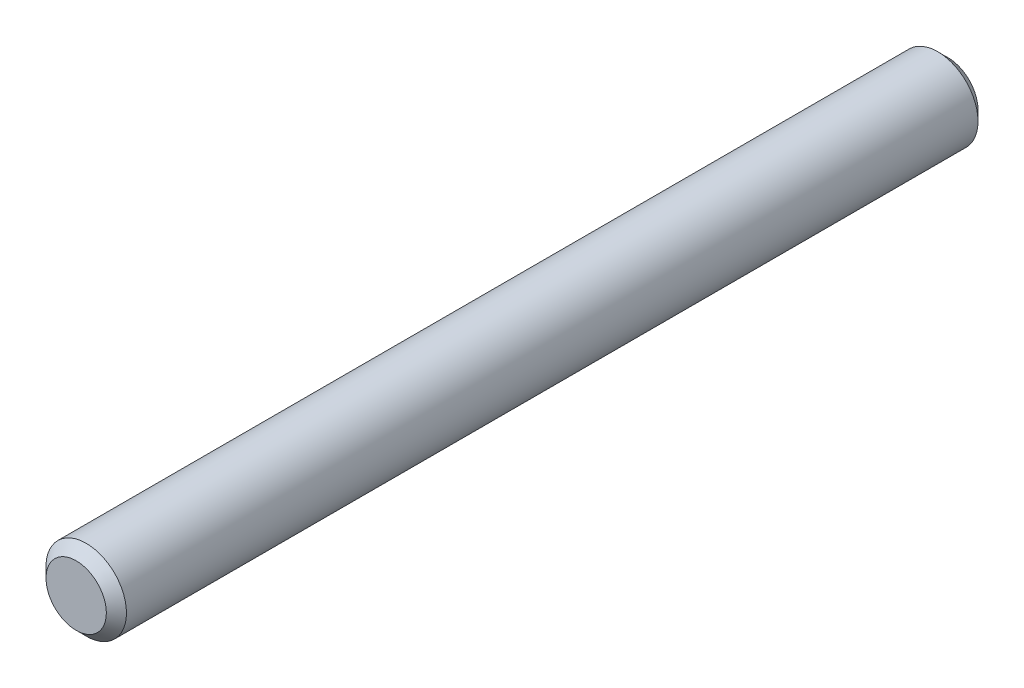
ISO-10303-21;
HEADER;
FILE_DESCRIPTION(('STEP AP214'),'2;1');
FILE_NAME('part.step','',(''),(''),'','','');
FILE_SCHEMA(('AUTOMOTIVE_DESIGN { 1 0 10303 214 1 1 1 1 }'));
ENDSEC;
DATA;
#1=APPLICATION_CONTEXT('core data for automotive mechanical design processes');
#2=APPLICATION_PROTOCOL_DEFINITION('international standard','automotive_design',2000,#1);
#3=PRODUCT_CONTEXT('',#1,'mechanical');
#4=PRODUCT('Part','Part','',(#3));
#5=PRODUCT_RELATED_PRODUCT_CATEGORY('part','',(#4));
#6=PRODUCT_DEFINITION_FORMATION('','',#4);
#7=PRODUCT_DEFINITION_CONTEXT('part definition',#1,'design');
#8=PRODUCT_DEFINITION('design','',#6,#7);
#9=PRODUCT_DEFINITION_SHAPE('','',#8);
#10=(LENGTH_UNIT() NAMED_UNIT(*) SI_UNIT(.MILLI.,.METRE.));
#11=(NAMED_UNIT(*) PLANE_ANGLE_UNIT() SI_UNIT($,.RADIAN.));
#12=(NAMED_UNIT(*) SI_UNIT($,.STERADIAN.) SOLID_ANGLE_UNIT());
#13=UNCERTAINTY_MEASURE_WITH_UNIT(LENGTH_MEASURE(1.E-05),#10,'distance_accuracy_value','');
#14=(GEOMETRIC_REPRESENTATION_CONTEXT(3) GLOBAL_UNCERTAINTY_ASSIGNED_CONTEXT((#13)) GLOBAL_UNIT_ASSIGNED_CONTEXT((#10,
#11,#12)) REPRESENTATION_CONTEXT('',''));
#15=CARTESIAN_POINT('',(0.,0.,0.));
#16=DIRECTION('',(0.,0.,1.));
#17=DIRECTION('',(1.,0.,0.));
#18=AXIS2_PLACEMENT_3D('',#15,#16,#17);
#19=CARTESIAN_POINT('',(0.,0.,-130.));
#20=DIRECTION('',(0.,0.,1.));
#21=DIRECTION('',(1.,0.,0.));
#22=AXIS2_PLACEMENT_3D('',#19,#20,#21);
#23=CYLINDRICAL_SURFACE('',#22,6.);
#24=CARTESIAN_POINT('',(0.,0.,-128.5));
#25=DIRECTION('',(0.,0.,1.));
#26=DIRECTION('',(1.,0.,0.));
#27=AXIS2_PLACEMENT_3D('',#24,#25,#26);
#28=CIRCLE('',#27,6.);
#29=CARTESIAN_POINT('',(6.,0.,-128.5));
#30=VERTEX_POINT('',#29);
#31=EDGE_CURVE('E46',#30,#30,#28,.T.);
#32=ORIENTED_EDGE('',*,*,#31,.T.);
#33=EDGE_LOOP('',(#32));
#34=FACE_BOUND('',#33,.T.);
#35=CARTESIAN_POINT('',(0.,0.,-1.5));
#36=DIRECTION('',(0.,0.,1.));
#37=DIRECTION('',(1.,0.,0.));
#38=AXIS2_PLACEMENT_3D('',#35,#36,#37);
#39=CIRCLE('',#38,6.);
#40=CARTESIAN_POINT('',(6.,0.,-1.5));
#41=VERTEX_POINT('',#40);
#42=EDGE_CURVE('E50',#41,#41,#39,.F.);
#43=ORIENTED_EDGE('',*,*,#42,.T.);
#44=EDGE_LOOP('',(#43));
#45=FACE_BOUND('',#44,.T.);
#46=ADVANCED_FACE('F35',(#34,#45),#23,.T.);
#47=CARTESIAN_POINT('',(0.,0.,-130.));
#48=DIRECTION('',(0.,0.,1.));
#49=DIRECTION('',(1.,0.,0.));
#50=AXIS2_PLACEMENT_3D('',#47,#48,#49);
#51=PLANE('',#50);
#52=CARTESIAN_POINT('',(0.,0.,-130.));
#53=DIRECTION('',(0.,0.,1.));
#54=DIRECTION('',(1.,0.,0.));
#55=AXIS2_PLACEMENT_3D('',#52,#53,#54);
#56=CIRCLE('',#55,4.49999999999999);
#57=CARTESIAN_POINT('',(4.49999999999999,0.,-130.));
#58=VERTEX_POINT('',#57);
#59=EDGE_CURVE('E42',#58,#58,#56,.F.);
#60=ORIENTED_EDGE('',*,*,#59,.T.);
#61=EDGE_LOOP('',(#60));
#62=FACE_BOUND('',#61,.T.);
#63=ADVANCED_FACE('F66',(#62),#51,.F.);
#64=CARTESIAN_POINT('',(0.,0.,0.));
#65=DIRECTION('',(0.,0.,1.));
#66=DIRECTION('',(1.,0.,0.));
#67=AXIS2_PLACEMENT_3D('',#64,#65,#66);
#68=PLANE('',#67);
#69=CARTESIAN_POINT('',(0.,0.,0.));
#70=DIRECTION('',(0.,0.,1.));
#71=DIRECTION('',(1.,0.,0.));
#72=AXIS2_PLACEMENT_3D('',#69,#70,#71);
#73=CIRCLE('',#72,4.50000000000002);
#74=CARTESIAN_POINT('',(4.50000000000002,0.,0.));
#75=VERTEX_POINT('',#74);
#76=EDGE_CURVE('E10',#75,#75,#73,.T.);
#77=ORIENTED_EDGE('',*,*,#76,.T.);
#78=EDGE_LOOP('',(#77));
#79=FACE_BOUND('',#78,.T.);
#80=ADVANCED_FACE('F63',(#79),#68,.T.);
#81=CARTESIAN_POINT('',(0.,0.,-128.5));
#82=DIRECTION('',(0.,0.,1.));
#83=DIRECTION('',(1.,0.,0.));
#84=AXIS2_PLACEMENT_3D('',#81,#82,#83);
#85=CONICAL_SURFACE('',#84,6.,0.785398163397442);
#86=ORIENTED_EDGE('',*,*,#59,.F.);
#87=EDGE_LOOP('',(#86));
#88=FACE_BOUND('',#87,.T.);
#89=ORIENTED_EDGE('',*,*,#31,.F.);
#90=EDGE_LOOP('',(#89));
#91=FACE_BOUND('',#90,.T.);
#92=ADVANCED_FACE('F59',(#88,#91),#85,.T.);
#93=CARTESIAN_POINT('',(0.,0.,0.));
#94=DIRECTION('',(0.,0.,-1.));
#95=DIRECTION('',(-1.,0.,0.));
#96=AXIS2_PLACEMENT_3D('',#93,#94,#95);
#97=CONICAL_SURFACE('',#96,4.50000000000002,0.785398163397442);
#98=ORIENTED_EDGE('',*,*,#42,.F.);
#99=EDGE_LOOP('',(#98));
#100=FACE_BOUND('',#99,.T.);
#101=ORIENTED_EDGE('',*,*,#76,.F.);
#102=EDGE_LOOP('',(#101));
#103=FACE_BOUND('',#102,.T.);
#104=ADVANCED_FACE('F37',(#100,#103),#97,.T.);
#105=CLOSED_SHELL('',(#46,#63,#80,#92,#104));
#106=MANIFOLD_SOLID_BREP('B2',#105);
#107=ADVANCED_BREP_SHAPE_REPRESENTATION('',(#18,#106),#14);
#108=SHAPE_DEFINITION_REPRESENTATION(#9,#107);
ENDSEC;
END-ISO-10303-21;
